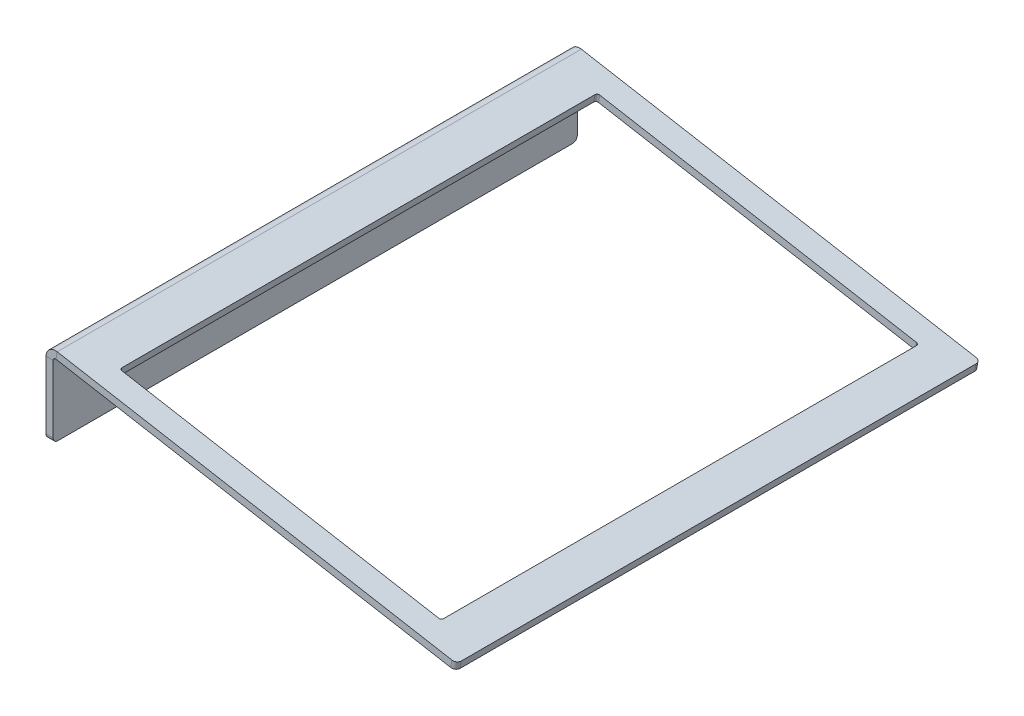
ISO-10303-21;
HEADER;
FILE_DESCRIPTION(('STEP AP214'),'2;1');
FILE_NAME('part.step','',(''),(''),'','','');
FILE_SCHEMA(('AUTOMOTIVE_DESIGN { 1 0 10303 214 1 1 1 1 }'));
ENDSEC;
DATA;
#1=APPLICATION_CONTEXT('core data for automotive mechanical design processes');
#2=APPLICATION_PROTOCOL_DEFINITION('international standard','automotive_design',2000,#1);
#3=PRODUCT_CONTEXT('',#1,'mechanical');
#4=PRODUCT('Part','Part','',(#3));
#5=PRODUCT_RELATED_PRODUCT_CATEGORY('part','',(#4));
#6=PRODUCT_DEFINITION_FORMATION('','',#4);
#7=PRODUCT_DEFINITION_CONTEXT('part definition',#1,'design');
#8=PRODUCT_DEFINITION('design','',#6,#7);
#9=PRODUCT_DEFINITION_SHAPE('','',#8);
#10=(LENGTH_UNIT() NAMED_UNIT(*) SI_UNIT(.MILLI.,.METRE.));
#11=(NAMED_UNIT(*) PLANE_ANGLE_UNIT() SI_UNIT($,.RADIAN.));
#12=(NAMED_UNIT(*) SI_UNIT($,.STERADIAN.) SOLID_ANGLE_UNIT());
#13=UNCERTAINTY_MEASURE_WITH_UNIT(LENGTH_MEASURE(1.E-05),#10,'distance_accuracy_value','');
#14=(GEOMETRIC_REPRESENTATION_CONTEXT(3) GLOBAL_UNCERTAINTY_ASSIGNED_CONTEXT((#13)) GLOBAL_UNIT_ASSIGNED_CONTEXT((#10,
#11,#12)) REPRESENTATION_CONTEXT('',''));
#15=CARTESIAN_POINT('',(0.,0.,0.));
#16=DIRECTION('',(0.,0.,1.));
#17=DIRECTION('',(1.,0.,0.));
#18=AXIS2_PLACEMENT_3D('',#15,#16,#17);
#19=CARTESIAN_POINT('',(0.,0.,110.));
#20=DIRECTION('',(-0.173648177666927,-0.984807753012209,0.));
#21=DIRECTION('',(0.984807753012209,-0.173648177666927,0.));
#22=AXIS2_PLACEMENT_3D('',#19,#20,#21);
#23=PLANE('',#22);
#24=DIRECTION('',(0.984807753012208,-0.173648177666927,0.));
#25=VECTOR('',#24,1.);
#26=CARTESIAN_POINT('',(155.107221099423,-27.349587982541,100.25));
#27=LINE('',#26,#25);
#28=CARTESIAN_POINT('',(22.1581744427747,-3.90708399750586,100.25));
#29=VERTEX_POINT('',#28);
#30=CARTESIAN_POINT('',(155.107221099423,-27.349587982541,100.25));
#31=VERTEX_POINT('',#30);
#32=EDGE_CURVE('E272',#29,#31,#27,.T.);
#33=ORIENTED_EDGE('',*,*,#32,.F.);
#34=CARTESIAN_POINT('',(22.1581744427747,-3.90708399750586,99.25));
#35=DIRECTION('',(0.173648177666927,0.984807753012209,0.));
#36=DIRECTION('',(-0.984807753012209,0.173648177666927,0.));
#37=AXIS2_PLACEMENT_3D('',#34,#35,#36);
#38=CIRCLE('',#37,1.00000000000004);
#39=CARTESIAN_POINT('',(21.1733666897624,-3.73343581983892,99.25));
#40=VERTEX_POINT('',#39);
#41=EDGE_CURVE('E237',#40,#29,#38,.T.);
#42=ORIENTED_EDGE('',*,*,#41,.F.);
#43=DIRECTION('',(0.,0.,1.));
#44=VECTOR('',#43,1.);
#45=CARTESIAN_POINT('',(21.1733666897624,-3.73343581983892,99.25));
#46=LINE('',#45,#44);
#47=CARTESIAN_POINT('',(21.1733666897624,-3.73343581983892,-99.25));
#48=VERTEX_POINT('',#47);
#49=EDGE_CURVE('E244',#48,#40,#46,.T.);
#50=ORIENTED_EDGE('',*,*,#49,.F.);
#51=CARTESIAN_POINT('',(22.1581744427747,-3.90708399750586,-99.25));
#52=DIRECTION('',(0.173648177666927,0.984807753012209,0.));
#53=DIRECTION('',(0.984807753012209,-0.173648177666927,0.));
#54=AXIS2_PLACEMENT_3D('',#51,#52,#53);
#55=CIRCLE('',#54,1.00000000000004);
#56=CARTESIAN_POINT('',(22.1581744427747,-3.90708399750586,-100.25));
#57=VERTEX_POINT('',#56);
#58=EDGE_CURVE('E249',#57,#48,#55,.T.);
#59=ORIENTED_EDGE('',*,*,#58,.F.);
#60=DIRECTION('',(-0.984807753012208,0.173648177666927,0.));
#61=VECTOR('',#60,1.);
#62=CARTESIAN_POINT('',(155.107221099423,-27.349587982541,-100.25));
#63=LINE('',#62,#61);
#64=CARTESIAN_POINT('',(155.107221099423,-27.349587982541,-100.25));
#65=VERTEX_POINT('',#64);
#66=EDGE_CURVE('E254',#65,#57,#63,.T.);
#67=ORIENTED_EDGE('',*,*,#66,.F.);
#68=CARTESIAN_POINT('',(155.107221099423,-27.349587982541,-99.25));
#69=DIRECTION('',(0.173648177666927,0.984807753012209,0.));
#70=DIRECTION('',(0.984807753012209,-0.173648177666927,0.));
#71=AXIS2_PLACEMENT_3D('',#68,#69,#70);
#72=CIRCLE('',#71,1.00000000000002);
#73=CARTESIAN_POINT('',(156.092028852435,-27.523236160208,-99.25));
#74=VERTEX_POINT('',#73);
#75=EDGE_CURVE('E259',#74,#65,#72,.T.);
#76=ORIENTED_EDGE('',*,*,#75,.F.);
#77=DIRECTION('',(0.,0.,-1.));
#78=VECTOR('',#77,1.);
#79=CARTESIAN_POINT('',(156.092028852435,-27.523236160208,99.25));
#80=LINE('',#79,#78);
#81=CARTESIAN_POINT('',(156.092028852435,-27.523236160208,99.25));
#82=VERTEX_POINT('',#81);
#83=EDGE_CURVE('E264',#82,#74,#80,.T.);
#84=ORIENTED_EDGE('',*,*,#83,.F.);
#85=CARTESIAN_POINT('',(155.107221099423,-27.349587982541,99.25));
#86=DIRECTION('',(0.173648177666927,0.984807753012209,0.));
#87=DIRECTION('',(0.984807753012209,-0.173648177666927,0.));
#88=AXIS2_PLACEMENT_3D('',#85,#86,#87);
#89=CIRCLE('',#88,1.00000000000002);
#90=EDGE_CURVE('E269',#31,#82,#89,.T.);
#91=ORIENTED_EDGE('',*,*,#90,.F.);
#92=EDGE_LOOP('',(#33,#42,#50,#59,#67,#76,#84,#91));
#93=FACE_BOUND('',#92,.T.);
#94=DIRECTION('',(-0.984807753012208,0.173648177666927,0.));
#95=VECTOR('',#94,1.);
#96=CARTESIAN_POINT('',(0.,0.,-110.));
#97=LINE('',#96,#95);
#98=CARTESIAN_POINT('',(170.371741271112,-30.0411347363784,-110.));
#99=VERTEX_POINT('',#98);
#100=CARTESIAN_POINT('',(4.69459271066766,-0.827783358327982,-110.));
#101=VERTEX_POINT('',#100);
#102=EDGE_CURVE('E197',#99,#101,#97,.T.);
#103=ORIENTED_EDGE('',*,*,#102,.T.);
#104=DIRECTION('',(0.,0.,1.));
#105=VECTOR('',#104,1.);
#106=CARTESIAN_POINT('',(4.69459271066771,-0.827783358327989,-110.));
#107=LINE('',#106,#105);
#108=CARTESIAN_POINT('',(4.69459271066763,-0.827783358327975,110.));
#109=VERTEX_POINT('',#108);
#110=EDGE_CURVE('E196',#101,#109,#107,.T.);
#111=ORIENTED_EDGE('',*,*,#110,.T.);
#112=DIRECTION('',(-0.984807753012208,0.173648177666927,0.));
#113=VECTOR('',#112,1.);
#114=CARTESIAN_POINT('',(0.,0.,110.));
#115=LINE('',#114,#113);
#116=CARTESIAN_POINT('',(170.371741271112,-30.0411347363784,110.));
#117=VERTEX_POINT('',#116);
#118=EDGE_CURVE('E275',#117,#109,#115,.T.);
#119=ORIENTED_EDGE('',*,*,#118,.F.);
#120=CARTESIAN_POINT('',(170.371741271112,-30.0411347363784,108.));
#121=DIRECTION('',(-0.173648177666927,-0.984807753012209,0.));
#122=DIRECTION('',(0.984807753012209,-0.173648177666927,0.));
#123=AXIS2_PLACEMENT_3D('',#120,#121,#122);
#124=CIRCLE('',#123,2.);
#125=CARTESIAN_POINT('',(172.341356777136,-30.3884310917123,108.));
#126=VERTEX_POINT('',#125);
#127=EDGE_CURVE('E221',#117,#126,#124,.F.);
#128=ORIENTED_EDGE('',*,*,#127,.T.);
#129=DIRECTION('',(0.,0.,-1.));
#130=VECTOR('',#129,1.);
#131=CARTESIAN_POINT('',(172.341356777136,-30.3884310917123,110.));
#132=LINE('',#131,#130);
#133=CARTESIAN_POINT('',(172.341356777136,-30.3884310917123,-108.));
#134=VERTEX_POINT('',#133);
#135=EDGE_CURVE('E218',#126,#134,#132,.T.);
#136=ORIENTED_EDGE('',*,*,#135,.T.);
#137=CARTESIAN_POINT('',(170.371741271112,-30.0411347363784,-108.));
#138=DIRECTION('',(-0.173648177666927,-0.984807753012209,0.));
#139=DIRECTION('',(0.984807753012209,-0.173648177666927,0.));
#140=AXIS2_PLACEMENT_3D('',#137,#138,#139);
#141=CIRCLE('',#140,2.);
#142=EDGE_CURVE('E203',#134,#99,#141,.F.);
#143=ORIENTED_EDGE('',*,*,#142,.T.);
#144=EDGE_LOOP('',(#103,#111,#119,#128,#136,#143));
#145=FACE_BOUND('',#144,.T.);
#146=ADVANCED_FACE('F28',(#93,#145),#23,.F.);
#147=CARTESIAN_POINT('',(149.121667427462,-61.2953497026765,100.25));
#148=DIRECTION('',(0.,0.,1.));
#149=DIRECTION('',(1.,0.,0.));
#150=AXIS2_PLACEMENT_3D('',#147,#148,#149);
#151=PLANE('',#150);
#152=DIRECTION('',(0.173648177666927,0.984807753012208,0.));
#153=VECTOR('',#152,1.);
#154=CARTESIAN_POINT('',(16.1726207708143,-37.8528457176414,100.25));
#155=LINE('',#154,#153);
#156=CARTESIAN_POINT('',(21.6372299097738,-6.86150725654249,100.25));
#157=VERTEX_POINT('',#156);
#158=EDGE_CURVE('E239',#157,#29,#155,.T.);
#159=ORIENTED_EDGE('',*,*,#158,.T.);
#160=ORIENTED_EDGE('',*,*,#32,.T.);
#161=DIRECTION('',(0.173648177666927,0.984807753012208,0.));
#162=VECTOR('',#161,1.);
#163=CARTESIAN_POINT('',(149.121667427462,-61.2953497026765,100.25));
#164=LINE('',#163,#162);
#165=CARTESIAN_POINT('',(154.586276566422,-30.3040112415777,100.25));
#166=VERTEX_POINT('',#165);
#167=EDGE_CURVE('E267',#166,#31,#164,.T.);
#168=ORIENTED_EDGE('',*,*,#167,.F.);
#169=DIRECTION('',(0.984807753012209,-0.173648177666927,0.));
#170=VECTOR('',#169,1.);
#171=CARTESIAN_POINT('',(154.586276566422,-30.3040112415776,100.25));
#172=LINE('',#171,#170);
#173=EDGE_CURVE('E355',#157,#166,#172,.T.);
#174=ORIENTED_EDGE('',*,*,#173,.F.);
#175=EDGE_LOOP('',(#159,#160,#168,#174));
#176=FACE_BOUND('',#175,.T.);
#177=ADVANCED_FACE('F386',(#176),#151,.F.);
#178=CARTESIAN_POINT('',(149.121667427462,-61.2953497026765,99.25));
#179=DIRECTION('',(0.173648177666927,0.984807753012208,0.));
#180=DIRECTION('',(-0.984807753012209,0.173648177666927,0.));
#181=AXIS2_PLACEMENT_3D('',#178,#179,#180);
#182=CYLINDRICAL_SURFACE('',#181,1.00000000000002);
#183=ORIENTED_EDGE('',*,*,#167,.T.);
#184=ORIENTED_EDGE('',*,*,#90,.T.);
#185=DIRECTION('',(0.173648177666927,0.984807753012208,0.));
#186=VECTOR('',#185,1.);
#187=CARTESIAN_POINT('',(150.106475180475,-61.4689978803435,99.25));
#188=LINE('',#187,#186);
#189=CARTESIAN_POINT('',(155.571084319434,-30.4776594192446,99.25));
#190=VERTEX_POINT('',#189);
#191=EDGE_CURVE('E262',#190,#82,#188,.T.);
#192=ORIENTED_EDGE('',*,*,#191,.F.);
#193=CARTESIAN_POINT('',(154.586276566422,-30.3040112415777,99.25));
#194=DIRECTION('',(-0.173648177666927,-0.984807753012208,0.));
#195=DIRECTION('',(0.984807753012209,-0.173648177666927,0.));
#196=AXIS2_PLACEMENT_3D('',#193,#194,#195);
#197=CIRCLE('',#196,1.00000000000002);
#198=EDGE_CURVE('E357',#166,#190,#197,.F.);
#199=ORIENTED_EDGE('',*,*,#198,.F.);
#200=EDGE_LOOP('',(#183,#184,#192,#199));
#201=FACE_BOUND('',#200,.T.);
#202=ADVANCED_FACE('F391',(#201),#182,.F.);
#203=CARTESIAN_POINT('',(150.106475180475,-61.4689978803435,99.25));
#204=DIRECTION('',(0.984807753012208,-0.173648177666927,0.));
#205=DIRECTION('',(0.173648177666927,0.984807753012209,0.));
#206=AXIS2_PLACEMENT_3D('',#203,#204,#205);
#207=PLANE('',#206);
#208=ORIENTED_EDGE('',*,*,#191,.T.);
#209=ORIENTED_EDGE('',*,*,#83,.T.);
#210=DIRECTION('',(0.173648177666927,0.984807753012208,0.));
#211=VECTOR('',#210,1.);
#212=CARTESIAN_POINT('',(150.106475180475,-61.4689978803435,-99.25));
#213=LINE('',#212,#211);
#214=CARTESIAN_POINT('',(155.571084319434,-30.4776594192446,-99.25));
#215=VERTEX_POINT('',#214);
#216=EDGE_CURVE('E257',#215,#74,#213,.T.);
#217=ORIENTED_EDGE('',*,*,#216,.F.);
#218=DIRECTION('',(0.,0.,-1.));
#219=VECTOR('',#218,1.);
#220=CARTESIAN_POINT('',(155.571084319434,-30.4776594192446,99.25));
#221=LINE('',#220,#219);
#222=EDGE_CURVE('E359',#190,#215,#221,.T.);
#223=ORIENTED_EDGE('',*,*,#222,.F.);
#224=EDGE_LOOP('',(#208,#209,#217,#223));
#225=FACE_BOUND('',#224,.T.);
#226=ADVANCED_FACE('F393',(#225),#207,.F.);
#227=CARTESIAN_POINT('',(149.121667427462,-61.2953497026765,-99.25));
#228=DIRECTION('',(0.173648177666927,0.984807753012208,0.));
#229=DIRECTION('',(-0.984807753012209,0.173648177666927,0.));
#230=AXIS2_PLACEMENT_3D('',#227,#228,#229);
#231=CYLINDRICAL_SURFACE('',#230,1.00000000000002);
#232=ORIENTED_EDGE('',*,*,#216,.T.);
#233=ORIENTED_EDGE('',*,*,#75,.T.);
#234=DIRECTION('',(0.173648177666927,0.984807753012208,0.));
#235=VECTOR('',#234,1.);
#236=CARTESIAN_POINT('',(149.121667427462,-61.2953497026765,-100.25));
#237=LINE('',#236,#235);
#238=CARTESIAN_POINT('',(154.586276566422,-30.3040112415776,-100.25));
#239=VERTEX_POINT('',#238);
#240=EDGE_CURVE('E252',#239,#65,#237,.T.);
#241=ORIENTED_EDGE('',*,*,#240,.F.);
#242=CARTESIAN_POINT('',(154.586276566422,-30.3040112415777,-99.25));
#243=DIRECTION('',(-0.173648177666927,-0.984807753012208,0.));
#244=DIRECTION('',(0.984807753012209,-0.173648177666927,0.));
#245=AXIS2_PLACEMENT_3D('',#242,#243,#244);
#246=CIRCLE('',#245,1.00000000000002);
#247=EDGE_CURVE('E361',#215,#239,#246,.F.);
#248=ORIENTED_EDGE('',*,*,#247,.F.);
#249=EDGE_LOOP('',(#232,#233,#241,#248));
#250=FACE_BOUND('',#249,.T.);
#251=ADVANCED_FACE('F399',(#250),#231,.F.);
#252=CARTESIAN_POINT('',(149.121667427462,-61.2953497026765,-100.25));
#253=DIRECTION('',(0.,0.,-1.));
#254=DIRECTION('',(-1.,0.,0.));
#255=AXIS2_PLACEMENT_3D('',#252,#253,#254);
#256=PLANE('',#255);
#257=ORIENTED_EDGE('',*,*,#240,.T.);
#258=ORIENTED_EDGE('',*,*,#66,.T.);
#259=DIRECTION('',(0.173648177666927,0.984807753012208,0.));
#260=VECTOR('',#259,1.);
#261=CARTESIAN_POINT('',(16.1726207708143,-37.8528457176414,-100.25));
#262=LINE('',#261,#260);
#263=CARTESIAN_POINT('',(21.6372299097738,-6.86150725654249,-100.25));
#264=VERTEX_POINT('',#263);
#265=EDGE_CURVE('E247',#264,#57,#262,.T.);
#266=ORIENTED_EDGE('',*,*,#265,.F.);
#267=DIRECTION('',(-0.984807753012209,0.173648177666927,0.));
#268=VECTOR('',#267,1.);
#269=CARTESIAN_POINT('',(154.586276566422,-30.3040112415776,-100.25));
#270=LINE('',#269,#268);
#271=EDGE_CURVE('E363',#239,#264,#270,.T.);
#272=ORIENTED_EDGE('',*,*,#271,.F.);
#273=EDGE_LOOP('',(#257,#258,#266,#272));
#274=FACE_BOUND('',#273,.T.);
#275=ADVANCED_FACE('F404',(#274),#256,.F.);
#276=CARTESIAN_POINT('',(16.1726207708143,-37.8528457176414,-99.25));
#277=DIRECTION('',(0.173648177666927,0.984807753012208,0.));
#278=DIRECTION('',(-0.984807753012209,0.173648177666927,0.));
#279=AXIS2_PLACEMENT_3D('',#276,#277,#278);
#280=CYLINDRICAL_SURFACE('',#279,1.00000000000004);
#281=ORIENTED_EDGE('',*,*,#265,.T.);
#282=ORIENTED_EDGE('',*,*,#58,.T.);
#283=DIRECTION('',(0.173648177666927,0.984807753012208,0.));
#284=VECTOR('',#283,1.);
#285=CARTESIAN_POINT('',(15.187813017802,-37.6791975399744,-99.25));
#286=LINE('',#285,#284);
#287=CARTESIAN_POINT('',(20.6524221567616,-6.68785907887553,-99.25));
#288=VERTEX_POINT('',#287);
#289=EDGE_CURVE('E242',#288,#48,#286,.T.);
#290=ORIENTED_EDGE('',*,*,#289,.F.);
#291=CARTESIAN_POINT('',(21.6372299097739,-6.86150725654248,-99.25));
#292=DIRECTION('',(-0.173648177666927,-0.984807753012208,0.));
#293=DIRECTION('',(0.984807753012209,-0.173648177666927,0.));
#294=AXIS2_PLACEMENT_3D('',#291,#292,#293);
#295=CIRCLE('',#294,1.00000000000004);
#296=EDGE_CURVE('E365',#264,#288,#295,.F.);
#297=ORIENTED_EDGE('',*,*,#296,.F.);
#298=EDGE_LOOP('',(#281,#282,#290,#297));
#299=FACE_BOUND('',#298,.T.);
#300=ADVANCED_FACE('F406',(#299),#280,.F.);
#301=CARTESIAN_POINT('',(15.187813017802,-37.6791975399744,99.25));
#302=DIRECTION('',(-0.984807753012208,0.173648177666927,0.));
#303=DIRECTION('',(-0.173648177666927,-0.984807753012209,0.));
#304=AXIS2_PLACEMENT_3D('',#301,#302,#303);
#305=PLANE('',#304);
#306=ORIENTED_EDGE('',*,*,#289,.T.);
#307=ORIENTED_EDGE('',*,*,#49,.T.);
#308=DIRECTION('',(0.173648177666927,0.984807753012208,0.));
#309=VECTOR('',#308,1.);
#310=CARTESIAN_POINT('',(15.187813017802,-37.6791975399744,99.25));
#311=LINE('',#310,#309);
#312=CARTESIAN_POINT('',(20.6524221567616,-6.68785907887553,99.25));
#313=VERTEX_POINT('',#312);
#314=EDGE_CURVE('E235',#313,#40,#311,.T.);
#315=ORIENTED_EDGE('',*,*,#314,.F.);
#316=DIRECTION('',(0.,0.,1.));
#317=VECTOR('',#316,1.);
#318=CARTESIAN_POINT('',(20.6524221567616,-6.68785907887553,99.25));
#319=LINE('',#318,#317);
#320=EDGE_CURVE('E230',#288,#313,#319,.T.);
#321=ORIENTED_EDGE('',*,*,#320,.F.);
#322=EDGE_LOOP('',(#306,#307,#315,#321));
#323=FACE_BOUND('',#322,.T.);
#324=ADVANCED_FACE('F373',(#323),#305,.F.);
#325=CARTESIAN_POINT('',(16.1726207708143,-37.8528457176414,99.25));
#326=DIRECTION('',(0.173648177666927,0.984807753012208,0.));
#327=DIRECTION('',(-0.984807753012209,0.173648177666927,0.));
#328=AXIS2_PLACEMENT_3D('',#325,#326,#327);
#329=CYLINDRICAL_SURFACE('',#328,1.00000000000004);
#330=ORIENTED_EDGE('',*,*,#314,.T.);
#331=ORIENTED_EDGE('',*,*,#41,.T.);
#332=ORIENTED_EDGE('',*,*,#158,.F.);
#333=CARTESIAN_POINT('',(21.6372299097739,-6.86150725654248,99.25));
#334=DIRECTION('',(-0.173648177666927,-0.984807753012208,0.));
#335=DIRECTION('',(0.984807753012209,-0.173648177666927,0.));
#336=AXIS2_PLACEMENT_3D('',#333,#334,#335);
#337=CIRCLE('',#336,1.00000000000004);
#338=EDGE_CURVE('E353',#313,#157,#337,.F.);
#339=ORIENTED_EDGE('',*,*,#338,.F.);
#340=EDGE_LOOP('',(#330,#331,#332,#339));
#341=FACE_BOUND('',#340,.T.);
#342=ADVANCED_FACE('F377',(#341),#329,.F.);
#343=CARTESIAN_POINT('',(-0.520944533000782,-2.95442325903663,110.));
#344=DIRECTION('',(-0.173648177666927,-0.984807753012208,0.));
#345=DIRECTION('',(0.984807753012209,-0.173648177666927,0.));
#346=AXIS2_PLACEMENT_3D('',#343,#344,#345);
#347=PLANE('',#346);
#348=DIRECTION('',(0.,0.,1.));
#349=VECTOR('',#348,1.);
#350=CARTESIAN_POINT('',(4.17364817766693,-3.78220661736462,-110.));
#351=LINE('',#350,#349);
#352=CARTESIAN_POINT('',(4.17364817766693,-3.78220661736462,-110.));
#353=VERTEX_POINT('',#352);
#354=CARTESIAN_POINT('',(4.17364817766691,-3.78220661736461,110.));
#355=VERTEX_POINT('',#354);
#356=EDGE_CURVE('E180',#353,#355,#351,.T.);
#357=ORIENTED_EDGE('',*,*,#356,.F.);
#358=DIRECTION('',(-0.984807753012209,0.173648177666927,0.));
#359=VECTOR('',#358,1.);
#360=CARTESIAN_POINT('',(-0.520944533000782,-2.95442325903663,-110.));
#361=LINE('',#360,#359);
#362=CARTESIAN_POINT('',(169.850796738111,-32.9955579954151,-110.));
#363=VERTEX_POINT('',#362);
#364=EDGE_CURVE('E188',#363,#353,#361,.T.);
#365=ORIENTED_EDGE('',*,*,#364,.F.);
#366=CARTESIAN_POINT('',(169.850796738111,-32.995557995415,-108.));
#367=DIRECTION('',(-0.173648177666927,-0.984807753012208,0.));
#368=DIRECTION('',(0.984807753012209,-0.173648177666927,0.));
#369=AXIS2_PLACEMENT_3D('',#366,#367,#368);
#370=CIRCLE('',#369,2.);
#371=CARTESIAN_POINT('',(171.820412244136,-33.3428543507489,-108.));
#372=VERTEX_POINT('',#371);
#373=EDGE_CURVE('E43',#363,#372,#370,.T.);
#374=ORIENTED_EDGE('',*,*,#373,.T.);
#375=DIRECTION('',(0.,0.,-1.));
#376=VECTOR('',#375,1.);
#377=CARTESIAN_POINT('',(171.820412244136,-33.3428543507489,110.));
#378=LINE('',#377,#376);
#379=CARTESIAN_POINT('',(171.820412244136,-33.3428543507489,108.));
#380=VERTEX_POINT('',#379);
#381=EDGE_CURVE('E51',#380,#372,#378,.T.);
#382=ORIENTED_EDGE('',*,*,#381,.F.);
#383=CARTESIAN_POINT('',(169.850796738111,-32.995557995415,108.));
#384=DIRECTION('',(-0.173648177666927,-0.984807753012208,0.));
#385=DIRECTION('',(0.984807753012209,-0.173648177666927,0.));
#386=AXIS2_PLACEMENT_3D('',#383,#384,#385);
#387=CIRCLE('',#386,2.);
#388=CARTESIAN_POINT('',(169.850796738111,-32.9955579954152,110.));
#389=VERTEX_POINT('',#388);
#390=EDGE_CURVE('E227',#380,#389,#387,.T.);
#391=ORIENTED_EDGE('',*,*,#390,.T.);
#392=DIRECTION('',(-0.984807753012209,0.173648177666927,0.));
#393=VECTOR('',#392,1.);
#394=CARTESIAN_POINT('',(-0.520944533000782,-2.95442325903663,110.));
#395=LINE('',#394,#393);
#396=EDGE_CURVE('E190',#389,#355,#395,.T.);
#397=ORIENTED_EDGE('',*,*,#396,.T.);
#398=EDGE_LOOP('',(#357,#365,#374,#382,#391,#397));
#399=FACE_BOUND('',#398,.T.);
#400=ORIENTED_EDGE('',*,*,#338,.T.);
#401=ORIENTED_EDGE('',*,*,#173,.T.);
#402=ORIENTED_EDGE('',*,*,#198,.T.);
#403=ORIENTED_EDGE('',*,*,#222,.T.);
#404=ORIENTED_EDGE('',*,*,#247,.T.);
#405=ORIENTED_EDGE('',*,*,#271,.T.);
#406=ORIENTED_EDGE('',*,*,#296,.T.);
#407=ORIENTED_EDGE('',*,*,#320,.T.);
#408=EDGE_LOOP('',(#400,#401,#402,#403,#404,#405,#406,#407));
#409=FACE_BOUND('',#408,.T.);
#410=ADVANCED_FACE('F193',(#399,#409),#347,.T.);
#411=CARTESIAN_POINT('',(-96.6078769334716,-547.890496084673,-110.));
#412=DIRECTION('',(0.,0.,-1.));
#413=DIRECTION('',(0.173648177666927,0.984807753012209,0.));
#414=AXIS2_PLACEMENT_3D('',#411,#412,#413);
#415=PLANE('',#414);
#416=ORIENTED_EDGE('',*,*,#102,.F.);
#417=DIRECTION('',(0.173648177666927,0.984807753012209,0.));
#418=VECTOR('',#417,1.);
#419=CARTESIAN_POINT('',(73.7638643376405,-577.931630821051,-110.));
#420=LINE('',#419,#418);
#421=EDGE_CURVE('E36',#363,#99,#420,.T.);
#422=ORIENTED_EDGE('',*,*,#421,.F.);
#423=ORIENTED_EDGE('',*,*,#364,.T.);
#424=DIRECTION('',(0.173648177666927,0.984807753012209,0.));
#425=VECTOR('',#424,1.);
#426=CARTESIAN_POINT('',(-91.9132842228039,-548.718279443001,-110.));
#427=LINE('',#426,#425);
#428=EDGE_CURVE('E11',#353,#101,#427,.T.);
#429=ORIENTED_EDGE('',*,*,#428,.T.);
#430=EDGE_LOOP('',(#416,#422,#423,#429));
#431=FACE_BOUND('',#430,.T.);
#432=ADVANCED_FACE('F30',(#431),#415,.T.);
#433=CARTESIAN_POINT('',(73.7638643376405,-577.931630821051,-108.));
#434=DIRECTION('',(0.173648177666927,0.984807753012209,0.));
#435=DIRECTION('',(-0.984807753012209,0.173648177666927,0.));
#436=AXIS2_PLACEMENT_3D('',#433,#434,#435);
#437=CYLINDRICAL_SURFACE('',#436,2.);
#438=ORIENTED_EDGE('',*,*,#421,.T.);
#439=ORIENTED_EDGE('',*,*,#142,.F.);
#440=DIRECTION('',(0.173648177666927,0.984807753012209,0.));
#441=VECTOR('',#440,1.);
#442=CARTESIAN_POINT('',(75.7334798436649,-578.278927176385,-108.));
#443=LINE('',#442,#441);
#444=EDGE_CURVE('E214',#372,#134,#443,.T.);
#445=ORIENTED_EDGE('',*,*,#444,.F.);
#446=ORIENTED_EDGE('',*,*,#373,.F.);
#447=EDGE_LOOP('',(#438,#439,#445,#446));
#448=FACE_BOUND('',#447,.T.);
#449=ADVANCED_FACE('F216',(#448),#437,.T.);
#450=CARTESIAN_POINT('',(75.7334798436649,-578.278927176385,110.));
#451=DIRECTION('',(0.984807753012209,-0.173648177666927,0.));
#452=DIRECTION('',(0.173648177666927,0.984807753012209,0.));
#453=AXIS2_PLACEMENT_3D('',#450,#451,#452);
#454=PLANE('',#453);
#455=ORIENTED_EDGE('',*,*,#135,.F.);
#456=DIRECTION('',(0.173648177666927,0.984807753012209,0.));
#457=VECTOR('',#456,1.);
#458=CARTESIAN_POINT('',(75.7334798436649,-578.278927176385,108.));
#459=LINE('',#458,#457);
#460=EDGE_CURVE('E211',#380,#126,#459,.T.);
#461=ORIENTED_EDGE('',*,*,#460,.F.);
#462=ORIENTED_EDGE('',*,*,#381,.T.);
#463=ORIENTED_EDGE('',*,*,#444,.T.);
#464=EDGE_LOOP('',(#455,#461,#462,#463));
#465=FACE_BOUND('',#464,.T.);
#466=ADVANCED_FACE('F220',(#465),#454,.T.);
#467=CARTESIAN_POINT('',(73.7638643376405,-577.931630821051,108.));
#468=DIRECTION('',(0.173648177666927,0.984807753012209,0.));
#469=DIRECTION('',(-0.984807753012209,0.173648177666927,0.));
#470=AXIS2_PLACEMENT_3D('',#467,#468,#469);
#471=CYLINDRICAL_SURFACE('',#470,2.);
#472=ORIENTED_EDGE('',*,*,#460,.T.);
#473=ORIENTED_EDGE('',*,*,#127,.F.);
#474=DIRECTION('',(0.173648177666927,0.984807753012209,0.));
#475=VECTOR('',#474,1.);
#476=CARTESIAN_POINT('',(73.7638643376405,-577.931630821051,110.));
#477=LINE('',#476,#475);
#478=EDGE_CURVE('E208',#389,#117,#477,.T.);
#479=ORIENTED_EDGE('',*,*,#478,.F.);
#480=ORIENTED_EDGE('',*,*,#390,.F.);
#481=EDGE_LOOP('',(#472,#473,#479,#480));
#482=FACE_BOUND('',#481,.T.);
#483=ADVANCED_FACE('F225',(#482),#471,.T.);
#484=CARTESIAN_POINT('',(-96.6078769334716,-547.890496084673,110.));
#485=DIRECTION('',(0.,0.,-1.));
#486=DIRECTION('',(0.173648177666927,0.984807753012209,0.));
#487=AXIS2_PLACEMENT_3D('',#484,#485,#486);
#488=PLANE('',#487);
#489=ORIENTED_EDGE('',*,*,#478,.T.);
#490=ORIENTED_EDGE('',*,*,#118,.T.);
#491=DIRECTION('',(0.173648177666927,0.984807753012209,0.));
#492=VECTOR('',#491,1.);
#493=CARTESIAN_POINT('',(-91.9132842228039,-548.718279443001,110.));
#494=LINE('',#493,#492);
#495=EDGE_CURVE('E200',#355,#109,#494,.T.);
#496=ORIENTED_EDGE('',*,*,#495,.F.);
#497=ORIENTED_EDGE('',*,*,#396,.F.);
#498=EDGE_LOOP('',(#489,#490,#496,#497));
#499=FACE_BOUND('',#498,.T.);
#500=ADVANCED_FACE('F280',(#499),#488,.F.);
#501=CARTESIAN_POINT('',(0.,0.,110.));
#502=DIRECTION('',(1.,0.,0.));
#503=DIRECTION('',(0.,1.,0.));
#504=AXIS2_PLACEMENT_3D('',#501,#502,#503);
#505=PLANE('',#504);
#506=CARTESIAN_POINT('',(0.,-20.,90.));
#507=DIRECTION('',(1.,0.,0.));
#508=DIRECTION('',(0.,1.,0.));
#509=AXIS2_PLACEMENT_3D('',#506,#507,#508);
#510=CIRCLE('',#509,3.50000000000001);
#511=CARTESIAN_POINT('',(0.,-16.5,90.));
#512=VERTEX_POINT('',#511);
#513=EDGE_CURVE('E319',#512,#512,#510,.T.);
#514=ORIENTED_EDGE('',*,*,#513,.T.);
#515=EDGE_LOOP('',(#514));
#516=FACE_BOUND('',#515,.T.);
#517=CARTESIAN_POINT('',(0.,-20.,-90.));
#518=DIRECTION('',(1.,0.,0.));
#519=DIRECTION('',(0.,-1.,0.));
#520=AXIS2_PLACEMENT_3D('',#517,#518,#519);
#521=CIRCLE('',#520,3.50000000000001);
#522=CARTESIAN_POINT('',(0.,-23.5,-90.));
#523=VERTEX_POINT('',#522);
#524=EDGE_CURVE('E316',#523,#523,#521,.T.);
#525=ORIENTED_EDGE('',*,*,#524,.T.);
#526=EDGE_LOOP('',(#525));
#527=FACE_BOUND('',#526,.T.);
#528=DIRECTION('',(0.,0.,1.));
#529=VECTOR('',#528,1.);
#530=CARTESIAN_POINT('',(0.,-4.76701437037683,-110.));
#531=LINE('',#530,#529);
#532=CARTESIAN_POINT('',(0.,-4.76701437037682,-110.));
#533=VERTEX_POINT('',#532);
#534=CARTESIAN_POINT('',(0.,-4.76701437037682,110.));
#535=VERTEX_POINT('',#534);
#536=EDGE_CURVE('E290',#533,#535,#531,.T.);
#537=ORIENTED_EDGE('',*,*,#536,.F.);
#538=DIRECTION('',(0.,-1.,0.));
#539=VECTOR('',#538,1.);
#540=CARTESIAN_POINT('',(0.,0.,-110.));
#541=LINE('',#540,#539);
#542=CARTESIAN_POINT('',(0.,-33.,-110.));
#543=VERTEX_POINT('',#542);
#544=EDGE_CURVE('E330',#533,#543,#541,.T.);
#545=ORIENTED_EDGE('',*,*,#544,.T.);
#546=CARTESIAN_POINT('',(0.,-33.,-108.));
#547=DIRECTION('',(1.,0.,0.));
#548=DIRECTION('',(0.,1.,0.));
#549=AXIS2_PLACEMENT_3D('',#546,#547,#548);
#550=CIRCLE('',#549,2.);
#551=CARTESIAN_POINT('',(0.,-35.,-108.));
#552=VERTEX_POINT('',#551);
#553=EDGE_CURVE('E332',#543,#552,#550,.F.);
#554=ORIENTED_EDGE('',*,*,#553,.T.);
#555=DIRECTION('',(0.,0.,-1.));
#556=VECTOR('',#555,1.);
#557=CARTESIAN_POINT('',(0.,-35.,110.));
#558=LINE('',#557,#556);
#559=CARTESIAN_POINT('',(0.,-35.,108.));
#560=VERTEX_POINT('',#559);
#561=EDGE_CURVE('E322',#560,#552,#558,.T.);
#562=ORIENTED_EDGE('',*,*,#561,.F.);
#563=CARTESIAN_POINT('',(0.,-33.,108.));
#564=DIRECTION('',(1.,0.,0.));
#565=DIRECTION('',(0.,1.,0.));
#566=AXIS2_PLACEMENT_3D('',#563,#564,#565);
#567=CIRCLE('',#566,2.);
#568=CARTESIAN_POINT('',(0.,-33.,110.));
#569=VERTEX_POINT('',#568);
#570=EDGE_CURVE('E325',#560,#569,#567,.F.);
#571=ORIENTED_EDGE('',*,*,#570,.T.);
#572=DIRECTION('',(0.,-1.,0.));
#573=VECTOR('',#572,1.);
#574=CARTESIAN_POINT('',(0.,0.,110.));
#575=LINE('',#574,#573);
#576=EDGE_CURVE('E327',#535,#569,#575,.T.);
#577=ORIENTED_EDGE('',*,*,#576,.F.);
#578=EDGE_LOOP('',(#537,#545,#554,#562,#571,#577));
#579=FACE_BOUND('',#578,.T.);
#580=ADVANCED_FACE('F449',(#516,#527,#579),#505,.F.);
#581=CARTESIAN_POINT('',(3.,0.,110.));
#582=DIRECTION('',(1.,0.,0.));
#583=DIRECTION('',(0.,1.,0.));
#584=AXIS2_PLACEMENT_3D('',#581,#582,#583);
#585=PLANE('',#584);
#586=CARTESIAN_POINT('',(3.,-20.,90.));
#587=DIRECTION('',(1.,0.,0.));
#588=DIRECTION('',(0.,1.,0.));
#589=AXIS2_PLACEMENT_3D('',#586,#587,#588);
#590=CIRCLE('',#589,3.50000000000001);
#591=CARTESIAN_POINT('',(3.,-16.5,90.));
#592=VERTEX_POINT('',#591);
#593=EDGE_CURVE('E294',#592,#592,#590,.T.);
#594=ORIENTED_EDGE('',*,*,#593,.F.);
#595=EDGE_LOOP('',(#594));
#596=FACE_BOUND('',#595,.T.);
#597=CARTESIAN_POINT('',(3.,-20.,-90.));
#598=DIRECTION('',(1.,0.,0.));
#599=DIRECTION('',(0.,-1.,0.));
#600=AXIS2_PLACEMENT_3D('',#597,#598,#599);
#601=CIRCLE('',#600,3.50000000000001);
#602=CARTESIAN_POINT('',(3.,-23.5,-90.));
#603=VERTEX_POINT('',#602);
#604=EDGE_CURVE('E291',#603,#603,#601,.T.);
#605=ORIENTED_EDGE('',*,*,#604,.F.);
#606=EDGE_LOOP('',(#605));
#607=FACE_BOUND('',#606,.T.);
#608=DIRECTION('',(0.,-1.,0.));
#609=VECTOR('',#608,1.);
#610=CARTESIAN_POINT('',(3.,0.,-110.));
#611=LINE('',#610,#609);
#612=CARTESIAN_POINT('',(3.,-4.76701437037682,-110.));
#613=VERTEX_POINT('',#612);
#614=CARTESIAN_POINT('',(3.,-33.,-110.));
#615=VERTEX_POINT('',#614);
#616=EDGE_CURVE('E313',#613,#615,#611,.T.);
#617=ORIENTED_EDGE('',*,*,#616,.F.);
#618=DIRECTION('',(0.,0.,1.));
#619=VECTOR('',#618,1.);
#620=CARTESIAN_POINT('',(3.,-4.76701437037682,-110.));
#621=LINE('',#620,#619);
#622=CARTESIAN_POINT('',(3.,-4.76701437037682,110.));
#623=VERTEX_POINT('',#622);
#624=EDGE_CURVE('E183',#613,#623,#621,.T.);
#625=ORIENTED_EDGE('',*,*,#624,.T.);
#626=DIRECTION('',(0.,-1.,0.));
#627=VECTOR('',#626,1.);
#628=CARTESIAN_POINT('',(3.,0.,110.));
#629=LINE('',#628,#627);
#630=CARTESIAN_POINT('',(3.,-33.,110.));
#631=VERTEX_POINT('',#630);
#632=EDGE_CURVE('E301',#623,#631,#629,.T.);
#633=ORIENTED_EDGE('',*,*,#632,.T.);
#634=CARTESIAN_POINT('',(3.,-33.,108.));
#635=DIRECTION('',(1.,0.,0.));
#636=DIRECTION('',(0.,1.,0.));
#637=AXIS2_PLACEMENT_3D('',#634,#635,#636);
#638=CIRCLE('',#637,2.);
#639=CARTESIAN_POINT('',(3.,-35.,108.));
#640=VERTEX_POINT('',#639);
#641=EDGE_CURVE('E304',#631,#640,#638,.T.);
#642=ORIENTED_EDGE('',*,*,#641,.T.);
#643=DIRECTION('',(0.,0.,-1.));
#644=VECTOR('',#643,1.);
#645=CARTESIAN_POINT('',(3.,-35.,110.));
#646=LINE('',#645,#644);
#647=CARTESIAN_POINT('',(3.,-35.,-108.));
#648=VERTEX_POINT('',#647);
#649=EDGE_CURVE('E307',#640,#648,#646,.T.);
#650=ORIENTED_EDGE('',*,*,#649,.T.);
#651=CARTESIAN_POINT('',(3.,-33.,-108.));
#652=DIRECTION('',(1.,0.,0.));
#653=DIRECTION('',(0.,1.,0.));
#654=AXIS2_PLACEMENT_3D('',#651,#652,#653);
#655=CIRCLE('',#654,2.);
#656=EDGE_CURVE('E310',#648,#615,#655,.T.);
#657=ORIENTED_EDGE('',*,*,#656,.T.);
#658=EDGE_LOOP('',(#617,#625,#633,#642,#650,#657));
#659=FACE_BOUND('',#658,.T.);
#660=ADVANCED_FACE('F447',(#596,#607,#659),#585,.T.);
#661=CARTESIAN_POINT('',(0.,-20.,90.));
#662=DIRECTION('',(1.,0.,0.));
#663=DIRECTION('',(0.,1.,0.));
#664=AXIS2_PLACEMENT_3D('',#661,#662,#663);
#665=CYLINDRICAL_SURFACE('',#664,3.50000000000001);
#666=ORIENTED_EDGE('',*,*,#513,.F.);
#667=EDGE_LOOP('',(#666));
#668=FACE_BOUND('',#667,.T.);
#669=ORIENTED_EDGE('',*,*,#593,.T.);
#670=EDGE_LOOP('',(#669));
#671=FACE_BOUND('',#670,.T.);
#672=ADVANCED_FACE('F429',(#668,#671),#665,.F.);
#673=CARTESIAN_POINT('',(0.,-20.,-90.));
#674=DIRECTION('',(1.,0.,0.));
#675=DIRECTION('',(0.,1.,0.));
#676=AXIS2_PLACEMENT_3D('',#673,#674,#675);
#677=CYLINDRICAL_SURFACE('',#676,3.50000000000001);
#678=ORIENTED_EDGE('',*,*,#524,.F.);
#679=EDGE_LOOP('',(#678));
#680=FACE_BOUND('',#679,.T.);
#681=ORIENTED_EDGE('',*,*,#604,.T.);
#682=EDGE_LOOP('',(#681));
#683=FACE_BOUND('',#682,.T.);
#684=ADVANCED_FACE('F427',(#680,#683),#677,.F.);
#685=CARTESIAN_POINT('',(444.135265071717,0.,-110.));
#686=DIRECTION('',(0.,0.,-1.));
#687=DIRECTION('',(-1.,0.,0.));
#688=AXIS2_PLACEMENT_3D('',#685,#686,#687);
#689=PLANE('',#688);
#690=ORIENTED_EDGE('',*,*,#544,.F.);
#691=DIRECTION('',(-1.,0.,0.));
#692=VECTOR('',#691,1.);
#693=CARTESIAN_POINT('',(444.135265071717,-4.76701437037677,-110.));
#694=LINE('',#693,#692);
#695=EDGE_CURVE('E351',#613,#533,#694,.T.);
#696=ORIENTED_EDGE('',*,*,#695,.F.);
#697=ORIENTED_EDGE('',*,*,#616,.T.);
#698=DIRECTION('',(-1.,0.,0.));
#699=VECTOR('',#698,1.);
#700=CARTESIAN_POINT('',(444.135265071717,-32.9999999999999,-110.));
#701=LINE('',#700,#699);
#702=EDGE_CURVE('E336',#615,#543,#701,.T.);
#703=ORIENTED_EDGE('',*,*,#702,.T.);
#704=EDGE_LOOP('',(#690,#696,#697,#703));
#705=FACE_BOUND('',#704,.T.);
#706=ADVANCED_FACE('F423',(#705),#689,.T.);
#707=CARTESIAN_POINT('',(444.135265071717,0.,110.));
#708=DIRECTION('',(0.,0.,-1.));
#709=DIRECTION('',(-1.,0.,0.));
#710=AXIS2_PLACEMENT_3D('',#707,#708,#709);
#711=PLANE('',#710);
#712=DIRECTION('',(-1.,0.,0.));
#713=VECTOR('',#712,1.);
#714=CARTESIAN_POINT('',(444.135265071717,-4.76701437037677,110.));
#715=LINE('',#714,#713);
#716=EDGE_CURVE('E348',#623,#535,#715,.T.);
#717=ORIENTED_EDGE('',*,*,#716,.T.);
#718=ORIENTED_EDGE('',*,*,#576,.T.);
#719=DIRECTION('',(-1.,0.,0.));
#720=VECTOR('',#719,1.);
#721=CARTESIAN_POINT('',(444.135265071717,-32.9999999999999,110.));
#722=LINE('',#721,#720);
#723=EDGE_CURVE('E345',#631,#569,#722,.T.);
#724=ORIENTED_EDGE('',*,*,#723,.F.);
#725=ORIENTED_EDGE('',*,*,#632,.F.);
#726=EDGE_LOOP('',(#717,#718,#724,#725));
#727=FACE_BOUND('',#726,.T.);
#728=ADVANCED_FACE('F426',(#727),#711,.F.);
#729=CARTESIAN_POINT('',(444.135265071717,-32.9999999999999,108.));
#730=DIRECTION('',(-1.,0.,0.));
#731=DIRECTION('',(0.,-1.,0.));
#732=AXIS2_PLACEMENT_3D('',#729,#730,#731);
#733=CYLINDRICAL_SURFACE('',#732,2.);
#734=ORIENTED_EDGE('',*,*,#723,.T.);
#735=ORIENTED_EDGE('',*,*,#570,.F.);
#736=DIRECTION('',(-1.,0.,0.));
#737=VECTOR('',#736,1.);
#738=CARTESIAN_POINT('',(444.135265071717,-35.,108.));
#739=LINE('',#738,#737);
#740=EDGE_CURVE('E342',#640,#560,#739,.T.);
#741=ORIENTED_EDGE('',*,*,#740,.F.);
#742=ORIENTED_EDGE('',*,*,#641,.F.);
#743=EDGE_LOOP('',(#734,#735,#741,#742));
#744=FACE_BOUND('',#743,.T.);
#745=ADVANCED_FACE('F432',(#744),#733,.T.);
#746=CARTESIAN_POINT('',(444.135265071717,-35.,110.));
#747=DIRECTION('',(0.,1.,0.));
#748=DIRECTION('',(-1.,0.,0.));
#749=AXIS2_PLACEMENT_3D('',#746,#747,#748);
#750=PLANE('',#749);
#751=ORIENTED_EDGE('',*,*,#740,.T.);
#752=ORIENTED_EDGE('',*,*,#561,.T.);
#753=DIRECTION('',(-1.,0.,0.));
#754=VECTOR('',#753,1.);
#755=CARTESIAN_POINT('',(444.135265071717,-35.,-108.));
#756=LINE('',#755,#754);
#757=EDGE_CURVE('E339',#648,#552,#756,.T.);
#758=ORIENTED_EDGE('',*,*,#757,.F.);
#759=ORIENTED_EDGE('',*,*,#649,.F.);
#760=EDGE_LOOP('',(#751,#752,#758,#759));
#761=FACE_BOUND('',#760,.T.);
#762=ADVANCED_FACE('F436',(#761),#750,.F.);
#763=CARTESIAN_POINT('',(444.135265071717,-32.9999999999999,-108.));
#764=DIRECTION('',(-1.,0.,0.));
#765=DIRECTION('',(0.,-1.,0.));
#766=AXIS2_PLACEMENT_3D('',#763,#764,#765);
#767=CYLINDRICAL_SURFACE('',#766,2.);
#768=ORIENTED_EDGE('',*,*,#757,.T.);
#769=ORIENTED_EDGE('',*,*,#553,.F.);
#770=ORIENTED_EDGE('',*,*,#702,.F.);
#771=ORIENTED_EDGE('',*,*,#656,.F.);
#772=EDGE_LOOP('',(#768,#769,#770,#771));
#773=FACE_BOUND('',#772,.T.);
#774=ADVANCED_FACE('F440',(#773),#767,.T.);
#775=CARTESIAN_POINT('',(4.,-4.76701437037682,110.));
#776=DIRECTION('',(0.,0.,1.));
#777=DIRECTION('',(1.,0.,0.));
#778=AXIS2_PLACEMENT_3D('',#775,#776,#777);
#779=PLANE('',#778);
#780=ORIENTED_EDGE('',*,*,#716,.F.);
#781=CARTESIAN_POINT('',(4.,-4.76701437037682,110.));
#782=DIRECTION('',(0.,0.,1.));
#783=DIRECTION('',(1.,0.,0.));
#784=AXIS2_PLACEMENT_3D('',#781,#782,#783);
#785=CIRCLE('',#784,1.);
#786=EDGE_CURVE('E185',#623,#355,#785,.F.);
#787=ORIENTED_EDGE('',*,*,#786,.T.);
#788=ORIENTED_EDGE('',*,*,#495,.T.);
#789=CARTESIAN_POINT('',(4.,-4.76701437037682,110.));
#790=DIRECTION('',(0.,0.,1.));
#791=DIRECTION('',(1.,0.,0.));
#792=AXIS2_PLACEMENT_3D('',#789,#790,#791);
#793=CIRCLE('',#792,4.);
#794=EDGE_CURVE('E285',#535,#109,#793,.F.);
#795=ORIENTED_EDGE('',*,*,#794,.F.);
#796=EDGE_LOOP('',(#780,#787,#788,#795));
#797=FACE_BOUND('',#796,.T.);
#798=ADVANCED_FACE('F284',(#797),#779,.T.);
#799=CARTESIAN_POINT('',(4.,-4.76701437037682,-110.));
#800=DIRECTION('',(0.,0.,-1.));
#801=DIRECTION('',(-1.,0.,0.));
#802=AXIS2_PLACEMENT_3D('',#799,#800,#801);
#803=PLANE('',#802);
#804=ORIENTED_EDGE('',*,*,#428,.F.);
#805=CARTESIAN_POINT('',(4.,-4.76701437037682,-110.));
#806=DIRECTION('',(0.,0.,1.));
#807=DIRECTION('',(1.,0.,0.));
#808=AXIS2_PLACEMENT_3D('',#805,#806,#807);
#809=CIRCLE('',#808,1.);
#810=EDGE_CURVE('E168',#353,#613,#809,.T.);
#811=ORIENTED_EDGE('',*,*,#810,.T.);
#812=ORIENTED_EDGE('',*,*,#695,.T.);
#813=CARTESIAN_POINT('',(4.,-4.76701437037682,-110.));
#814=DIRECTION('',(0.,0.,1.));
#815=DIRECTION('',(1.,0.,0.));
#816=AXIS2_PLACEMENT_3D('',#813,#814,#815);
#817=CIRCLE('',#816,4.);
#818=EDGE_CURVE('E171',#101,#533,#817,.T.);
#819=ORIENTED_EDGE('',*,*,#818,.F.);
#820=EDGE_LOOP('',(#804,#811,#812,#819));
#821=FACE_BOUND('',#820,.T.);
#822=ADVANCED_FACE('F167',(#821),#803,.T.);
#823=CARTESIAN_POINT('',(4.,-4.76701437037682,-410.018528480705));
#824=DIRECTION('',(0.,0.,1.));
#825=DIRECTION('',(1.,0.,0.));
#826=AXIS2_PLACEMENT_3D('',#823,#824,#825);
#827=CYLINDRICAL_SURFACE('',#826,4.);
#828=ORIENTED_EDGE('',*,*,#818,.T.);
#829=ORIENTED_EDGE('',*,*,#536,.T.);
#830=ORIENTED_EDGE('',*,*,#794,.T.);
#831=ORIENTED_EDGE('',*,*,#110,.F.);
#832=EDGE_LOOP('',(#828,#829,#830,#831));
#833=FACE_BOUND('',#832,.T.);
#834=ADVANCED_FACE('F288',(#833),#827,.T.);
#835=CARTESIAN_POINT('',(4.,-4.76701437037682,-410.018528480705));
#836=DIRECTION('',(0.,0.,1.));
#837=DIRECTION('',(1.,0.,0.));
#838=AXIS2_PLACEMENT_3D('',#835,#836,#837);
#839=CYLINDRICAL_SURFACE('',#838,1.);
#840=ORIENTED_EDGE('',*,*,#810,.F.);
#841=ORIENTED_EDGE('',*,*,#356,.T.);
#842=ORIENTED_EDGE('',*,*,#786,.F.);
#843=ORIENTED_EDGE('',*,*,#624,.F.);
#844=EDGE_LOOP('',(#840,#841,#842,#843));
#845=FACE_BOUND('',#844,.T.);
#846=ADVANCED_FACE('F177',(#845),#839,.F.);
#847=CLOSED_SHELL('',(#146,#177,#202,#226,#251,#275,#300,#324,#342,#410,#432,#449,#466,#483,
#500,#580,#660,#672,#684,#706,#728,#745,#762,#774,#798,#822,#834,#846));
#848=MANIFOLD_SOLID_BREP('B2',#847);
#849=ADVANCED_BREP_SHAPE_REPRESENTATION('',(#18,#848),#14);
#850=SHAPE_DEFINITION_REPRESENTATION(#9,#849);
ENDSEC;
END-ISO-10303-21;
